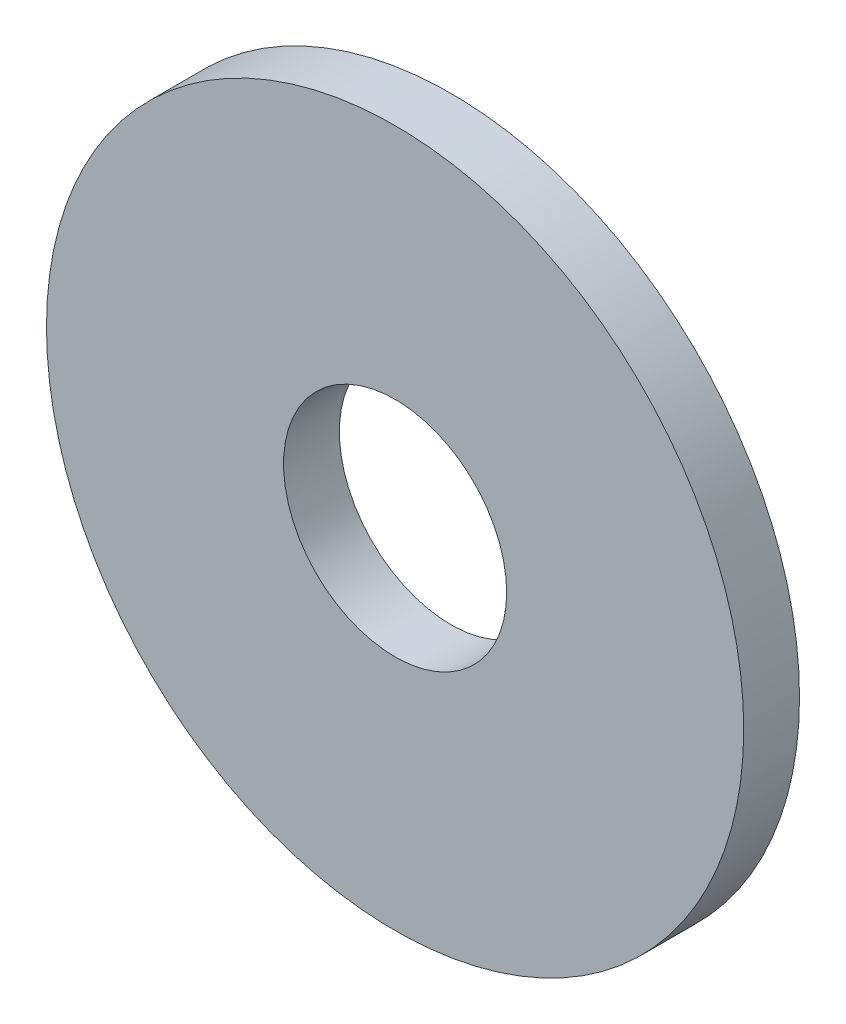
ISO-10303-21;
HEADER;
FILE_DESCRIPTION(('STEP AP214'),'2;1');
FILE_NAME('part.step','',(''),(''),'','','');
FILE_SCHEMA(('AUTOMOTIVE_DESIGN { 1 0 10303 214 1 1 1 1 }'));
ENDSEC;
DATA;
#1=APPLICATION_CONTEXT('core data for automotive mechanical design processes');
#2=APPLICATION_PROTOCOL_DEFINITION('international standard','automotive_design',2000,#1);
#3=PRODUCT_CONTEXT('',#1,'mechanical');
#4=PRODUCT('Part','Part','',(#3));
#5=PRODUCT_RELATED_PRODUCT_CATEGORY('part','',(#4));
#6=PRODUCT_DEFINITION_FORMATION('','',#4);
#7=PRODUCT_DEFINITION_CONTEXT('part definition',#1,'design');
#8=PRODUCT_DEFINITION('design','',#6,#7);
#9=PRODUCT_DEFINITION_SHAPE('','',#8);
#10=(LENGTH_UNIT() NAMED_UNIT(*) SI_UNIT(.MILLI.,.METRE.));
#11=(NAMED_UNIT(*) PLANE_ANGLE_UNIT() SI_UNIT($,.RADIAN.));
#12=(NAMED_UNIT(*) SI_UNIT($,.STERADIAN.) SOLID_ANGLE_UNIT());
#13=UNCERTAINTY_MEASURE_WITH_UNIT(LENGTH_MEASURE(1.E-05),#10,'distance_accuracy_value','');
#14=(GEOMETRIC_REPRESENTATION_CONTEXT(3) GLOBAL_UNCERTAINTY_ASSIGNED_CONTEXT((#13)) GLOBAL_UNIT_ASSIGNED_CONTEXT((#10,
#11,#12)) REPRESENTATION_CONTEXT('',''));
#15=CARTESIAN_POINT('',(0.,0.,0.));
#16=DIRECTION('',(0.,0.,1.));
#17=DIRECTION('',(1.,0.,0.));
#18=AXIS2_PLACEMENT_3D('',#15,#16,#17);
#19=CARTESIAN_POINT('',(0.,0.,2.));
#20=DIRECTION('',(0.,0.,1.));
#21=DIRECTION('',(1.,0.,0.));
#22=AXIS2_PLACEMENT_3D('',#19,#20,#21);
#23=PLANE('',#22);
#24=CARTESIAN_POINT('',(0.,0.,2.));
#25=DIRECTION('',(0.,0.,1.));
#26=DIRECTION('',(1.,0.,0.));
#27=AXIS2_PLACEMENT_3D('',#24,#25,#26);
#28=CIRCLE('',#27,12.5);
#29=CARTESIAN_POINT('',(12.5,0.,2.));
#30=VERTEX_POINT('',#29);
#31=EDGE_CURVE('E10',#30,#30,#28,.T.);
#32=ORIENTED_EDGE('',*,*,#31,.T.);
#33=EDGE_LOOP('',(#32));
#34=FACE_BOUND('',#33,.T.);
#35=CARTESIAN_POINT('',(0.,0.,2.));
#36=DIRECTION('',(0.,0.,1.));
#37=DIRECTION('',(1.,0.,0.));
#38=AXIS2_PLACEMENT_3D('',#35,#36,#37);
#39=CIRCLE('',#38,4.);
#40=CARTESIAN_POINT('',(4.,0.,2.));
#41=VERTEX_POINT('',#40);
#42=EDGE_CURVE('E37',#41,#41,#39,.T.);
#43=ORIENTED_EDGE('',*,*,#42,.F.);
#44=EDGE_LOOP('',(#43));
#45=FACE_BOUND('',#44,.T.);
#46=ADVANCED_FACE('F26',(#34,#45),#23,.T.);
#47=CARTESIAN_POINT('',(0.,0.,0.));
#48=DIRECTION('',(0.,0.,1.));
#49=DIRECTION('',(1.,0.,0.));
#50=AXIS2_PLACEMENT_3D('',#47,#48,#49);
#51=PLANE('',#50);
#52=CARTESIAN_POINT('',(0.,0.,0.));
#53=DIRECTION('',(0.,0.,1.));
#54=DIRECTION('',(1.,0.,0.));
#55=AXIS2_PLACEMENT_3D('',#52,#53,#54);
#56=CIRCLE('',#55,12.5);
#57=CARTESIAN_POINT('',(12.5,0.,0.));
#58=VERTEX_POINT('',#57);
#59=EDGE_CURVE('E33',#58,#58,#56,.T.);
#60=ORIENTED_EDGE('',*,*,#59,.F.);
#61=EDGE_LOOP('',(#60));
#62=FACE_BOUND('',#61,.T.);
#63=CARTESIAN_POINT('',(0.,0.,0.));
#64=DIRECTION('',(0.,0.,1.));
#65=DIRECTION('',(1.,0.,0.));
#66=AXIS2_PLACEMENT_3D('',#63,#64,#65);
#67=CIRCLE('',#66,4.);
#68=CARTESIAN_POINT('',(4.,0.,0.));
#69=VERTEX_POINT('',#68);
#70=EDGE_CURVE('E41',#69,#69,#67,.T.);
#71=ORIENTED_EDGE('',*,*,#70,.T.);
#72=EDGE_LOOP('',(#71));
#73=FACE_BOUND('',#72,.T.);
#74=ADVANCED_FACE('F47',(#62,#73),#51,.F.);
#75=CARTESIAN_POINT('',(0.,0.,2.));
#76=DIRECTION('',(0.,0.,-1.));
#77=DIRECTION('',(-1.,0.,0.));
#78=AXIS2_PLACEMENT_3D('',#75,#76,#77);
#79=CYLINDRICAL_SURFACE('',#78,12.5);
#80=ORIENTED_EDGE('',*,*,#31,.F.);
#81=EDGE_LOOP('',(#80));
#82=FACE_BOUND('',#81,.T.);
#83=ORIENTED_EDGE('',*,*,#59,.T.);
#84=EDGE_LOOP('',(#83));
#85=FACE_BOUND('',#84,.T.);
#86=ADVANCED_FACE('F28',(#82,#85),#79,.T.);
#87=CARTESIAN_POINT('',(0.,0.,2.));
#88=DIRECTION('',(0.,0.,-1.));
#89=DIRECTION('',(-1.,0.,0.));
#90=AXIS2_PLACEMENT_3D('',#87,#88,#89);
#91=CYLINDRICAL_SURFACE('',#90,4.);
#92=ORIENTED_EDGE('',*,*,#42,.T.);
#93=EDGE_LOOP('',(#92));
#94=FACE_BOUND('',#93,.T.);
#95=ORIENTED_EDGE('',*,*,#70,.F.);
#96=EDGE_LOOP('',(#95));
#97=FACE_BOUND('',#96,.T.);
#98=ADVANCED_FACE('F49',(#94,#97),#91,.F.);
#99=CLOSED_SHELL('',(#46,#74,#86,#98));
#100=MANIFOLD_SOLID_BREP('B2',#99);
#101=ADVANCED_BREP_SHAPE_REPRESENTATION('',(#18,#100),#14);
#102=SHAPE_DEFINITION_REPRESENTATION(#9,#101);
ENDSEC;
END-ISO-10303-21;
